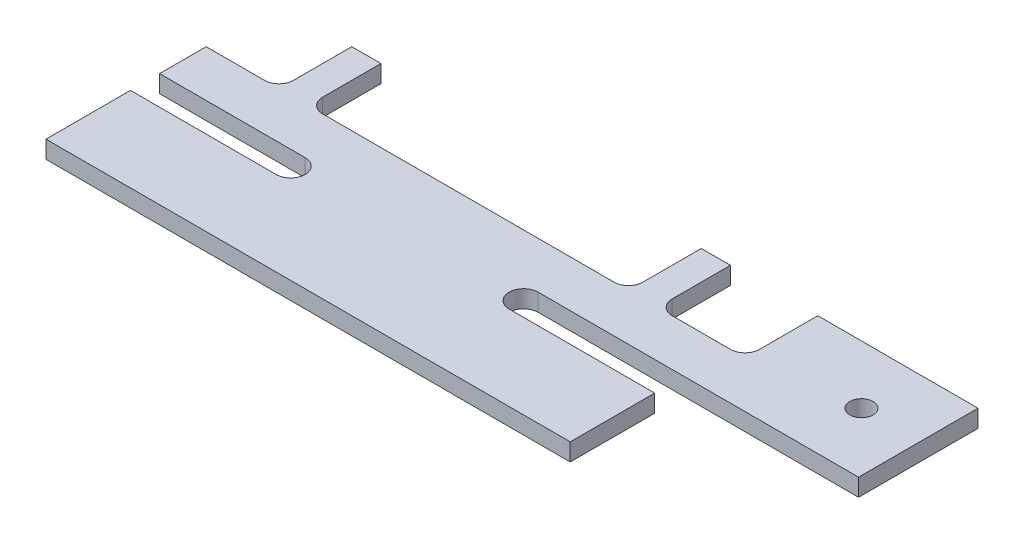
ISO-10303-21;
HEADER;
FILE_DESCRIPTION(('STEP AP214'),'2;1');
FILE_NAME('part.step','',(''),(''),'','','');
FILE_SCHEMA(('AUTOMOTIVE_DESIGN { 1 0 10303 214 1 1 1 1 }'));
ENDSEC;
DATA;
#1=APPLICATION_CONTEXT('core data for automotive mechanical design processes');
#2=APPLICATION_PROTOCOL_DEFINITION('international standard','automotive_design',2000,#1);
#3=PRODUCT_CONTEXT('',#1,'mechanical');
#4=PRODUCT('Part','Part','',(#3));
#5=PRODUCT_RELATED_PRODUCT_CATEGORY('part','',(#4));
#6=PRODUCT_DEFINITION_FORMATION('','',#4);
#7=PRODUCT_DEFINITION_CONTEXT('part definition',#1,'design');
#8=PRODUCT_DEFINITION('design','',#6,#7);
#9=PRODUCT_DEFINITION_SHAPE('','',#8);
#10=(LENGTH_UNIT() NAMED_UNIT(*) SI_UNIT(.MILLI.,.METRE.));
#11=(NAMED_UNIT(*) PLANE_ANGLE_UNIT() SI_UNIT($,.RADIAN.));
#12=(NAMED_UNIT(*) SI_UNIT($,.STERADIAN.) SOLID_ANGLE_UNIT());
#13=UNCERTAINTY_MEASURE_WITH_UNIT(LENGTH_MEASURE(1.E-05),#10,'distance_accuracy_value','');
#14=(GEOMETRIC_REPRESENTATION_CONTEXT(3) GLOBAL_UNCERTAINTY_ASSIGNED_CONTEXT((#13)) GLOBAL_UNIT_ASSIGNED_CONTEXT((#10,
#11,#12)) REPRESENTATION_CONTEXT('',''));
#15=CARTESIAN_POINT('',(0.,0.,0.));
#16=DIRECTION('',(0.,0.,1.));
#17=DIRECTION('',(1.,0.,0.));
#18=AXIS2_PLACEMENT_3D('',#15,#16,#17);
#19=CARTESIAN_POINT('',(25.,3.,-17.));
#20=DIRECTION('',(0.,1.,0.));
#21=DIRECTION('',(0.,0.,1.));
#22=AXIS2_PLACEMENT_3D('',#19,#20,#21);
#23=PLANE('',#22);
#24=DIRECTION('',(0.,0.,1.));
#25=VECTOR('',#24,1.);
#26=CARTESIAN_POINT('',(0.,3.,0.));
#27=LINE('',#26,#25);
#28=CARTESIAN_POINT('',(0.,3.,-14.5));
#29=VERTEX_POINT('',#28);
#30=CARTESIAN_POINT('',(0.,3.,0.));
#31=VERTEX_POINT('',#30);
#32=EDGE_CURVE('E286',#29,#31,#27,.T.);
#33=ORIENTED_EDGE('',*,*,#32,.T.);
#34=DIRECTION('',(1.,0.,0.));
#35=VECTOR('',#34,1.);
#36=CARTESIAN_POINT('',(0.,3.,0.));
#37=LINE('',#36,#35);
#38=CARTESIAN_POINT('',(90.,3.,0.));
#39=VERTEX_POINT('',#38);
#40=EDGE_CURVE('E225',#31,#39,#37,.T.);
#41=ORIENTED_EDGE('',*,*,#40,.T.);
#42=DIRECTION('',(0.,0.,-1.));
#43=VECTOR('',#42,1.);
#44=CARTESIAN_POINT('',(90.,3.,0.));
#45=LINE('',#44,#43);
#46=CARTESIAN_POINT('',(90.,3.,-14.5));
#47=VERTEX_POINT('',#46);
#48=EDGE_CURVE('E289',#39,#47,#45,.T.);
#49=ORIENTED_EDGE('',*,*,#48,.T.);
#50=DIRECTION('',(-1.,0.,0.));
#51=VECTOR('',#50,1.);
#52=CARTESIAN_POINT('',(65.,3.,-14.5));
#53=LINE('',#52,#51);
#54=CARTESIAN_POINT('',(65.,3.,-14.5));
#55=VERTEX_POINT('',#54);
#56=EDGE_CURVE('E291',#47,#55,#53,.T.);
#57=ORIENTED_EDGE('',*,*,#56,.T.);
#58=CARTESIAN_POINT('',(65.,3.,-17.));
#59=DIRECTION('',(0.,-1.,0.));
#60=DIRECTION('',(0.,0.,1.));
#61=AXIS2_PLACEMENT_3D('',#58,#59,#60);
#62=CIRCLE('',#61,2.5);
#63=CARTESIAN_POINT('',(65.,3.,-19.5));
#64=VERTEX_POINT('',#63);
#65=EDGE_CURVE('E293',#55,#64,#62,.T.);
#66=ORIENTED_EDGE('',*,*,#65,.T.);
#67=DIRECTION('',(1.,0.,0.));
#68=VECTOR('',#67,1.);
#69=CARTESIAN_POINT('',(65.,3.,-19.5));
#70=LINE('',#69,#68);
#71=CARTESIAN_POINT('',(120.,3.,-19.5));
#72=VERTEX_POINT('',#71);
#73=EDGE_CURVE('E295',#64,#72,#70,.T.);
#74=ORIENTED_EDGE('',*,*,#73,.T.);
#75=DIRECTION('',(0.,0.,-1.));
#76=VECTOR('',#75,1.);
#77=CARTESIAN_POINT('',(120.,3.,-19.5));
#78=LINE('',#77,#76);
#79=CARTESIAN_POINT('',(120.,3.,-40.));
#80=VERTEX_POINT('',#79);
#81=EDGE_CURVE('E297',#72,#80,#78,.T.);
#82=ORIENTED_EDGE('',*,*,#81,.T.);
#83=DIRECTION('',(-1.,0.,0.));
#84=VECTOR('',#83,1.);
#85=CARTESIAN_POINT('',(92.5,3.,-40.));
#86=LINE('',#85,#84);
#87=CARTESIAN_POINT('',(92.5,3.,-40.));
#88=VERTEX_POINT('',#87);
#89=EDGE_CURVE('E299',#80,#88,#86,.T.);
#90=ORIENTED_EDGE('',*,*,#89,.T.);
#91=DIRECTION('',(0.,0.,1.));
#92=VECTOR('',#91,1.);
#93=CARTESIAN_POINT('',(92.5,3.,-30.));
#94=LINE('',#93,#92);
#95=CARTESIAN_POINT('',(92.5,3.,-30.));
#96=VERTEX_POINT('',#95);
#97=EDGE_CURVE('E301',#88,#96,#94,.T.);
#98=ORIENTED_EDGE('',*,*,#97,.T.);
#99=CARTESIAN_POINT('',(90.,3.,-30.));
#100=DIRECTION('',(0.,-1.,0.));
#101=DIRECTION('',(0.,0.,-1.));
#102=AXIS2_PLACEMENT_3D('',#99,#100,#101);
#103=CIRCLE('',#102,2.5);
#104=CARTESIAN_POINT('',(90.,3.,-27.5));
#105=VERTEX_POINT('',#104);
#106=EDGE_CURVE('E303',#96,#105,#103,.T.);
#107=ORIENTED_EDGE('',*,*,#106,.T.);
#108=DIRECTION('',(-1.,0.,0.));
#109=VECTOR('',#108,1.);
#110=CARTESIAN_POINT('',(80.,3.,-27.5));
#111=LINE('',#110,#109);
#112=CARTESIAN_POINT('',(80.,3.,-27.5));
#113=VERTEX_POINT('',#112);
#114=EDGE_CURVE('E305',#105,#113,#111,.T.);
#115=ORIENTED_EDGE('',*,*,#114,.T.);
#116=CARTESIAN_POINT('',(80.,3.,-30.));
#117=DIRECTION('',(0.,-1.,0.));
#118=DIRECTION('',(0.,0.,-1.));
#119=AXIS2_PLACEMENT_3D('',#116,#117,#118);
#120=CIRCLE('',#119,2.5);
#121=CARTESIAN_POINT('',(77.5,3.,-30.));
#122=VERTEX_POINT('',#121);
#123=EDGE_CURVE('E307',#113,#122,#120,.T.);
#124=ORIENTED_EDGE('',*,*,#123,.T.);
#125=DIRECTION('',(0.,0.,-1.));
#126=VECTOR('',#125,1.);
#127=CARTESIAN_POINT('',(77.5,3.,-30.));
#128=LINE('',#127,#126);
#129=CARTESIAN_POINT('',(77.5,3.,-40.));
#130=VERTEX_POINT('',#129);
#131=EDGE_CURVE('E309',#122,#130,#128,.T.);
#132=ORIENTED_EDGE('',*,*,#131,.T.);
#133=DIRECTION('',(-1.,0.,0.));
#134=VECTOR('',#133,1.);
#135=CARTESIAN_POINT('',(72.5,3.,-40.));
#136=LINE('',#135,#134);
#137=CARTESIAN_POINT('',(72.5,3.,-40.));
#138=VERTEX_POINT('',#137);
#139=EDGE_CURVE('E311',#130,#138,#136,.T.);
#140=ORIENTED_EDGE('',*,*,#139,.T.);
#141=DIRECTION('',(0.,0.,1.));
#142=VECTOR('',#141,1.);
#143=CARTESIAN_POINT('',(72.5,3.,-30.));
#144=LINE('',#143,#142);
#145=CARTESIAN_POINT('',(72.5,3.,-30.));
#146=VERTEX_POINT('',#145);
#147=EDGE_CURVE('E313',#138,#146,#144,.T.);
#148=ORIENTED_EDGE('',*,*,#147,.T.);
#149=CARTESIAN_POINT('',(70.,3.,-30.));
#150=DIRECTION('',(0.,-1.,0.));
#151=DIRECTION('',(0.,0.,1.));
#152=AXIS2_PLACEMENT_3D('',#149,#150,#151);
#153=CIRCLE('',#152,2.5);
#154=CARTESIAN_POINT('',(70.,3.,-27.5));
#155=VERTEX_POINT('',#154);
#156=EDGE_CURVE('E315',#146,#155,#153,.T.);
#157=ORIENTED_EDGE('',*,*,#156,.T.);
#158=DIRECTION('',(-1.,0.,0.));
#159=VECTOR('',#158,1.);
#160=CARTESIAN_POINT('',(20.,3.,-27.5));
#161=LINE('',#160,#159);
#162=CARTESIAN_POINT('',(20.,3.,-27.5));
#163=VERTEX_POINT('',#162);
#164=EDGE_CURVE('E317',#155,#163,#161,.T.);
#165=ORIENTED_EDGE('',*,*,#164,.T.);
#166=CARTESIAN_POINT('',(20.,3.,-30.));
#167=DIRECTION('',(0.,-1.,0.));
#168=DIRECTION('',(0.,0.,-1.));
#169=AXIS2_PLACEMENT_3D('',#166,#167,#168);
#170=CIRCLE('',#169,2.5);
#171=CARTESIAN_POINT('',(17.5,3.,-30.));
#172=VERTEX_POINT('',#171);
#173=EDGE_CURVE('E319',#163,#172,#170,.T.);
#174=ORIENTED_EDGE('',*,*,#173,.T.);
#175=DIRECTION('',(0.,0.,-1.));
#176=VECTOR('',#175,1.);
#177=CARTESIAN_POINT('',(17.5,3.,-30.));
#178=LINE('',#177,#176);
#179=CARTESIAN_POINT('',(17.5,3.,-40.));
#180=VERTEX_POINT('',#179);
#181=EDGE_CURVE('E321',#172,#180,#178,.T.);
#182=ORIENTED_EDGE('',*,*,#181,.T.);
#183=DIRECTION('',(-1.,0.,0.));
#184=VECTOR('',#183,1.);
#185=CARTESIAN_POINT('',(12.5,3.,-40.));
#186=LINE('',#185,#184);
#187=CARTESIAN_POINT('',(12.5,3.,-40.));
#188=VERTEX_POINT('',#187);
#189=EDGE_CURVE('E323',#180,#188,#186,.T.);
#190=ORIENTED_EDGE('',*,*,#189,.T.);
#191=DIRECTION('',(0.,0.,1.));
#192=VECTOR('',#191,1.);
#193=CARTESIAN_POINT('',(12.5,3.,-30.));
#194=LINE('',#193,#192);
#195=CARTESIAN_POINT('',(12.5,3.,-30.));
#196=VERTEX_POINT('',#195);
#197=EDGE_CURVE('E325',#188,#196,#194,.T.);
#198=ORIENTED_EDGE('',*,*,#197,.T.);
#199=CARTESIAN_POINT('',(10.,3.,-30.));
#200=DIRECTION('',(0.,-1.,0.));
#201=DIRECTION('',(0.,0.,1.));
#202=AXIS2_PLACEMENT_3D('',#199,#200,#201);
#203=CIRCLE('',#202,2.5);
#204=CARTESIAN_POINT('',(9.99999999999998,3.,-27.5));
#205=VERTEX_POINT('',#204);
#206=EDGE_CURVE('E327',#196,#205,#203,.T.);
#207=ORIENTED_EDGE('',*,*,#206,.T.);
#208=DIRECTION('',(-1.,0.,0.));
#209=VECTOR('',#208,1.);
#210=CARTESIAN_POINT('',(0.,3.,-27.5));
#211=LINE('',#210,#209);
#212=CARTESIAN_POINT('',(0.,3.,-27.5));
#213=VERTEX_POINT('',#212);
#214=EDGE_CURVE('E329',#205,#213,#211,.T.);
#215=ORIENTED_EDGE('',*,*,#214,.T.);
#216=DIRECTION('',(0.,0.,1.));
#217=VECTOR('',#216,1.);
#218=CARTESIAN_POINT('',(0.,3.,-19.5));
#219=LINE('',#218,#217);
#220=CARTESIAN_POINT('',(0.,3.,-19.5));
#221=VERTEX_POINT('',#220);
#222=EDGE_CURVE('E331',#213,#221,#219,.T.);
#223=ORIENTED_EDGE('',*,*,#222,.T.);
#224=DIRECTION('',(1.,0.,0.));
#225=VECTOR('',#224,1.);
#226=CARTESIAN_POINT('',(0.,3.,-19.5));
#227=LINE('',#226,#225);
#228=CARTESIAN_POINT('',(25.,3.,-19.5));
#229=VERTEX_POINT('',#228);
#230=EDGE_CURVE('E333',#221,#229,#227,.T.);
#231=ORIENTED_EDGE('',*,*,#230,.T.);
#232=CARTESIAN_POINT('',(25.,3.,-17.));
#233=DIRECTION('',(0.,-1.,0.));
#234=DIRECTION('',(0.,0.,1.));
#235=AXIS2_PLACEMENT_3D('',#232,#233,#234);
#236=CIRCLE('',#235,2.5);
#237=CARTESIAN_POINT('',(25.,3.,-14.5));
#238=VERTEX_POINT('',#237);
#239=EDGE_CURVE('E52',#229,#238,#236,.T.);
#240=ORIENTED_EDGE('',*,*,#239,.T.);
#241=DIRECTION('',(-1.,0.,0.));
#242=VECTOR('',#241,1.);
#243=CARTESIAN_POINT('',(0.,3.,-14.5));
#244=LINE('',#243,#242);
#245=EDGE_CURVE('E47',#238,#29,#244,.T.);
#246=ORIENTED_EDGE('',*,*,#245,.T.);
#247=EDGE_LOOP('',(#33,#41,#49,#57,#66,#74,#82,#90,#98,#107,#115,#124,#132,#140,#148,#157,#165,
#174,#182,#190,#198,#207,#215,#223,#231,#240,#246));
#248=FACE_BOUND('',#247,.T.);
#249=CARTESIAN_POINT('',(110.,3.,-30.));
#250=DIRECTION('',(0.,1.,0.));
#251=DIRECTION('',(0.,0.,1.));
#252=AXIS2_PLACEMENT_3D('',#249,#250,#251);
#253=CIRCLE('',#252,2.);
#254=CARTESIAN_POINT('',(110.,3.,-28.));
#255=VERTEX_POINT('',#254);
#256=EDGE_CURVE('E230',#255,#255,#253,.T.);
#257=ORIENTED_EDGE('',*,*,#256,.F.);
#258=EDGE_LOOP('',(#257));
#259=FACE_BOUND('',#258,.T.);
#260=ADVANCED_FACE('F32',(#248,#259),#23,.T.);
#261=CARTESIAN_POINT('',(25.,0.,-17.));
#262=DIRECTION('',(0.,1.,0.));
#263=DIRECTION('',(0.,0.,1.));
#264=AXIS2_PLACEMENT_3D('',#261,#262,#263);
#265=PLANE('',#264);
#266=DIRECTION('',(0.,0.,1.));
#267=VECTOR('',#266,1.);
#268=CARTESIAN_POINT('',(0.,0.,0.));
#269=LINE('',#268,#267);
#270=CARTESIAN_POINT('',(0.,0.,-14.5));
#271=VERTEX_POINT('',#270);
#272=CARTESIAN_POINT('',(0.,0.,0.));
#273=VERTEX_POINT('',#272);
#274=EDGE_CURVE('E216',#271,#273,#269,.T.);
#275=ORIENTED_EDGE('',*,*,#274,.F.);
#276=DIRECTION('',(-1.,0.,0.));
#277=VECTOR('',#276,1.);
#278=CARTESIAN_POINT('',(0.,0.,-14.5));
#279=LINE('',#278,#277);
#280=CARTESIAN_POINT('',(25.,0.,-14.5));
#281=VERTEX_POINT('',#280);
#282=EDGE_CURVE('E284',#281,#271,#279,.T.);
#283=ORIENTED_EDGE('',*,*,#282,.F.);
#284=CARTESIAN_POINT('',(25.,0.,-17.));
#285=DIRECTION('',(0.,-1.,0.));
#286=DIRECTION('',(0.,0.,1.));
#287=AXIS2_PLACEMENT_3D('',#284,#285,#286);
#288=CIRCLE('',#287,2.5);
#289=CARTESIAN_POINT('',(25.,0.,-19.5));
#290=VERTEX_POINT('',#289);
#291=EDGE_CURVE('E282',#290,#281,#288,.T.);
#292=ORIENTED_EDGE('',*,*,#291,.F.);
#293=DIRECTION('',(1.,0.,0.));
#294=VECTOR('',#293,1.);
#295=CARTESIAN_POINT('',(0.,0.,-19.5));
#296=LINE('',#295,#294);
#297=CARTESIAN_POINT('',(0.,0.,-19.5));
#298=VERTEX_POINT('',#297);
#299=EDGE_CURVE('E280',#298,#290,#296,.T.);
#300=ORIENTED_EDGE('',*,*,#299,.F.);
#301=DIRECTION('',(0.,0.,1.));
#302=VECTOR('',#301,1.);
#303=CARTESIAN_POINT('',(0.,0.,-19.5));
#304=LINE('',#303,#302);
#305=CARTESIAN_POINT('',(0.,0.,-27.5));
#306=VERTEX_POINT('',#305);
#307=EDGE_CURVE('E278',#306,#298,#304,.T.);
#308=ORIENTED_EDGE('',*,*,#307,.F.);
#309=DIRECTION('',(-1.,0.,0.));
#310=VECTOR('',#309,1.);
#311=CARTESIAN_POINT('',(0.,0.,-27.5));
#312=LINE('',#311,#310);
#313=CARTESIAN_POINT('',(9.99999999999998,0.,-27.5));
#314=VERTEX_POINT('',#313);
#315=EDGE_CURVE('E276',#314,#306,#312,.T.);
#316=ORIENTED_EDGE('',*,*,#315,.F.);
#317=CARTESIAN_POINT('',(10.,0.,-30.));
#318=DIRECTION('',(0.,-1.,0.));
#319=DIRECTION('',(0.,0.,1.));
#320=AXIS2_PLACEMENT_3D('',#317,#318,#319);
#321=CIRCLE('',#320,2.5);
#322=CARTESIAN_POINT('',(12.5,0.,-30.));
#323=VERTEX_POINT('',#322);
#324=EDGE_CURVE('E274',#323,#314,#321,.T.);
#325=ORIENTED_EDGE('',*,*,#324,.F.);
#326=DIRECTION('',(0.,0.,1.));
#327=VECTOR('',#326,1.);
#328=CARTESIAN_POINT('',(12.5,0.,-30.));
#329=LINE('',#328,#327);
#330=CARTESIAN_POINT('',(12.5,0.,-40.));
#331=VERTEX_POINT('',#330);
#332=EDGE_CURVE('E272',#331,#323,#329,.T.);
#333=ORIENTED_EDGE('',*,*,#332,.F.);
#334=DIRECTION('',(-1.,0.,0.));
#335=VECTOR('',#334,1.);
#336=CARTESIAN_POINT('',(12.5,0.,-40.));
#337=LINE('',#336,#335);
#338=CARTESIAN_POINT('',(17.5,0.,-40.));
#339=VERTEX_POINT('',#338);
#340=EDGE_CURVE('E270',#339,#331,#337,.T.);
#341=ORIENTED_EDGE('',*,*,#340,.F.);
#342=DIRECTION('',(0.,0.,-1.));
#343=VECTOR('',#342,1.);
#344=CARTESIAN_POINT('',(17.5,0.,-30.));
#345=LINE('',#344,#343);
#346=CARTESIAN_POINT('',(17.5,0.,-30.));
#347=VERTEX_POINT('',#346);
#348=EDGE_CURVE('E268',#347,#339,#345,.T.);
#349=ORIENTED_EDGE('',*,*,#348,.F.);
#350=CARTESIAN_POINT('',(20.,0.,-30.));
#351=DIRECTION('',(0.,-1.,0.));
#352=DIRECTION('',(0.,0.,-1.));
#353=AXIS2_PLACEMENT_3D('',#350,#351,#352);
#354=CIRCLE('',#353,2.5);
#355=CARTESIAN_POINT('',(20.,0.,-27.5));
#356=VERTEX_POINT('',#355);
#357=EDGE_CURVE('E266',#356,#347,#354,.T.);
#358=ORIENTED_EDGE('',*,*,#357,.F.);
#359=DIRECTION('',(-1.,0.,0.));
#360=VECTOR('',#359,1.);
#361=CARTESIAN_POINT('',(20.,0.,-27.5));
#362=LINE('',#361,#360);
#363=CARTESIAN_POINT('',(70.,0.,-27.5));
#364=VERTEX_POINT('',#363);
#365=EDGE_CURVE('E264',#364,#356,#362,.T.);
#366=ORIENTED_EDGE('',*,*,#365,.F.);
#367=CARTESIAN_POINT('',(70.,0.,-30.));
#368=DIRECTION('',(0.,-1.,0.));
#369=DIRECTION('',(0.,0.,1.));
#370=AXIS2_PLACEMENT_3D('',#367,#368,#369);
#371=CIRCLE('',#370,2.5);
#372=CARTESIAN_POINT('',(72.5,0.,-30.));
#373=VERTEX_POINT('',#372);
#374=EDGE_CURVE('E262',#373,#364,#371,.T.);
#375=ORIENTED_EDGE('',*,*,#374,.F.);
#376=DIRECTION('',(0.,0.,1.));
#377=VECTOR('',#376,1.);
#378=CARTESIAN_POINT('',(72.5,0.,-30.));
#379=LINE('',#378,#377);
#380=CARTESIAN_POINT('',(72.5,0.,-40.));
#381=VERTEX_POINT('',#380);
#382=EDGE_CURVE('E260',#381,#373,#379,.T.);
#383=ORIENTED_EDGE('',*,*,#382,.F.);
#384=DIRECTION('',(-1.,0.,0.));
#385=VECTOR('',#384,1.);
#386=CARTESIAN_POINT('',(72.5,0.,-40.));
#387=LINE('',#386,#385);
#388=CARTESIAN_POINT('',(77.5,0.,-40.));
#389=VERTEX_POINT('',#388);
#390=EDGE_CURVE('E258',#389,#381,#387,.T.);
#391=ORIENTED_EDGE('',*,*,#390,.F.);
#392=DIRECTION('',(0.,0.,-1.));
#393=VECTOR('',#392,1.);
#394=CARTESIAN_POINT('',(77.5,0.,-30.));
#395=LINE('',#394,#393);
#396=CARTESIAN_POINT('',(77.5,0.,-30.));
#397=VERTEX_POINT('',#396);
#398=EDGE_CURVE('E256',#397,#389,#395,.T.);
#399=ORIENTED_EDGE('',*,*,#398,.F.);
#400=CARTESIAN_POINT('',(80.,0.,-30.));
#401=DIRECTION('',(0.,-1.,0.));
#402=DIRECTION('',(0.,0.,-1.));
#403=AXIS2_PLACEMENT_3D('',#400,#401,#402);
#404=CIRCLE('',#403,2.5);
#405=CARTESIAN_POINT('',(80.,0.,-27.5));
#406=VERTEX_POINT('',#405);
#407=EDGE_CURVE('E254',#406,#397,#404,.T.);
#408=ORIENTED_EDGE('',*,*,#407,.F.);
#409=DIRECTION('',(-1.,0.,0.));
#410=VECTOR('',#409,1.);
#411=CARTESIAN_POINT('',(80.,0.,-27.5));
#412=LINE('',#411,#410);
#413=CARTESIAN_POINT('',(90.,0.,-27.5));
#414=VERTEX_POINT('',#413);
#415=EDGE_CURVE('E252',#414,#406,#412,.T.);
#416=ORIENTED_EDGE('',*,*,#415,.F.);
#417=CARTESIAN_POINT('',(90.,0.,-30.));
#418=DIRECTION('',(0.,-1.,0.));
#419=DIRECTION('',(0.,0.,-1.));
#420=AXIS2_PLACEMENT_3D('',#417,#418,#419);
#421=CIRCLE('',#420,2.5);
#422=CARTESIAN_POINT('',(92.5,0.,-30.));
#423=VERTEX_POINT('',#422);
#424=EDGE_CURVE('E250',#423,#414,#421,.T.);
#425=ORIENTED_EDGE('',*,*,#424,.F.);
#426=DIRECTION('',(0.,0.,1.));
#427=VECTOR('',#426,1.);
#428=CARTESIAN_POINT('',(92.5,0.,-30.));
#429=LINE('',#428,#427);
#430=CARTESIAN_POINT('',(92.5,0.,-40.));
#431=VERTEX_POINT('',#430);
#432=EDGE_CURVE('E248',#431,#423,#429,.T.);
#433=ORIENTED_EDGE('',*,*,#432,.F.);
#434=DIRECTION('',(-1.,0.,0.));
#435=VECTOR('',#434,1.);
#436=CARTESIAN_POINT('',(92.5,0.,-40.));
#437=LINE('',#436,#435);
#438=CARTESIAN_POINT('',(120.,0.,-40.));
#439=VERTEX_POINT('',#438);
#440=EDGE_CURVE('E246',#439,#431,#437,.T.);
#441=ORIENTED_EDGE('',*,*,#440,.F.);
#442=DIRECTION('',(0.,0.,-1.));
#443=VECTOR('',#442,1.);
#444=CARTESIAN_POINT('',(120.,0.,-19.5));
#445=LINE('',#444,#443);
#446=CARTESIAN_POINT('',(120.,0.,-19.5));
#447=VERTEX_POINT('',#446);
#448=EDGE_CURVE('E244',#447,#439,#445,.T.);
#449=ORIENTED_EDGE('',*,*,#448,.F.);
#450=DIRECTION('',(1.,0.,0.));
#451=VECTOR('',#450,1.);
#452=CARTESIAN_POINT('',(65.,0.,-19.5));
#453=LINE('',#452,#451);
#454=CARTESIAN_POINT('',(65.,0.,-19.5));
#455=VERTEX_POINT('',#454);
#456=EDGE_CURVE('E242',#455,#447,#453,.T.);
#457=ORIENTED_EDGE('',*,*,#456,.F.);
#458=CARTESIAN_POINT('',(65.,0.,-17.));
#459=DIRECTION('',(0.,-1.,0.));
#460=DIRECTION('',(0.,0.,1.));
#461=AXIS2_PLACEMENT_3D('',#458,#459,#460);
#462=CIRCLE('',#461,2.5);
#463=CARTESIAN_POINT('',(65.,0.,-14.5));
#464=VERTEX_POINT('',#463);
#465=EDGE_CURVE('E240',#464,#455,#462,.T.);
#466=ORIENTED_EDGE('',*,*,#465,.F.);
#467=DIRECTION('',(-1.,0.,0.));
#468=VECTOR('',#467,1.);
#469=CARTESIAN_POINT('',(65.,0.,-14.5));
#470=LINE('',#469,#468);
#471=CARTESIAN_POINT('',(90.,0.,-14.5));
#472=VERTEX_POINT('',#471);
#473=EDGE_CURVE('E238',#472,#464,#470,.T.);
#474=ORIENTED_EDGE('',*,*,#473,.F.);
#475=DIRECTION('',(0.,0.,-1.));
#476=VECTOR('',#475,1.);
#477=CARTESIAN_POINT('',(90.,0.,0.));
#478=LINE('',#477,#476);
#479=CARTESIAN_POINT('',(90.,0.,0.));
#480=VERTEX_POINT('',#479);
#481=EDGE_CURVE('E218',#480,#472,#478,.T.);
#482=ORIENTED_EDGE('',*,*,#481,.F.);
#483=DIRECTION('',(1.,0.,0.));
#484=VECTOR('',#483,1.);
#485=CARTESIAN_POINT('',(0.,0.,0.));
#486=LINE('',#485,#484);
#487=EDGE_CURVE('E211',#273,#480,#486,.T.);
#488=ORIENTED_EDGE('',*,*,#487,.F.);
#489=EDGE_LOOP('',(#275,#283,#292,#300,#308,#316,#325,#333,#341,#349,#358,#366,#375,#383,#391,
#399,#408,#416,#425,#433,#441,#449,#457,#466,#474,#482,#488));
#490=FACE_BOUND('',#489,.T.);
#491=CARTESIAN_POINT('',(110.,0.,-30.));
#492=DIRECTION('',(0.,1.,0.));
#493=DIRECTION('',(0.,0.,1.));
#494=AXIS2_PLACEMENT_3D('',#491,#492,#493);
#495=CIRCLE('',#494,2.);
#496=CARTESIAN_POINT('',(110.,0.,-28.));
#497=VERTEX_POINT('',#496);
#498=EDGE_CURVE('E233',#497,#497,#495,.T.);
#499=ORIENTED_EDGE('',*,*,#498,.T.);
#500=EDGE_LOOP('',(#499));
#501=FACE_BOUND('',#500,.T.);
#502=ADVANCED_FACE('F212',(#490,#501),#265,.F.);
#503=CARTESIAN_POINT('',(0.,3.,0.));
#504=DIRECTION('',(1.,0.,0.));
#505=DIRECTION('',(0.,0.,-1.));
#506=AXIS2_PLACEMENT_3D('',#503,#504,#505);
#507=PLANE('',#506);
#508=ORIENTED_EDGE('',*,*,#274,.T.);
#509=DIRECTION('',(0.,-1.,0.));
#510=VECTOR('',#509,1.);
#511=CARTESIAN_POINT('',(0.,3.,0.));
#512=LINE('',#511,#510);
#513=EDGE_CURVE('E11',#31,#273,#512,.T.);
#514=ORIENTED_EDGE('',*,*,#513,.F.);
#515=ORIENTED_EDGE('',*,*,#32,.F.);
#516=DIRECTION('',(0.,-1.,0.));
#517=VECTOR('',#516,1.);
#518=CARTESIAN_POINT('',(0.,3.,-14.5));
#519=LINE('',#518,#517);
#520=EDGE_CURVE('E229',#29,#271,#519,.T.);
#521=ORIENTED_EDGE('',*,*,#520,.T.);
#522=EDGE_LOOP('',(#508,#514,#515,#521));
#523=FACE_BOUND('',#522,.T.);
#524=ADVANCED_FACE('F34',(#523),#507,.F.);
#525=CARTESIAN_POINT('',(0.,3.,0.));
#526=DIRECTION('',(0.,0.,-1.));
#527=DIRECTION('',(-1.,0.,0.));
#528=AXIS2_PLACEMENT_3D('',#525,#526,#527);
#529=PLANE('',#528);
#530=ORIENTED_EDGE('',*,*,#487,.T.);
#531=DIRECTION('',(0.,-1.,0.));
#532=VECTOR('',#531,1.);
#533=CARTESIAN_POINT('',(90.,3.,0.));
#534=LINE('',#533,#532);
#535=EDGE_CURVE('E40',#39,#480,#534,.T.);
#536=ORIENTED_EDGE('',*,*,#535,.F.);
#537=ORIENTED_EDGE('',*,*,#40,.F.);
#538=ORIENTED_EDGE('',*,*,#513,.T.);
#539=EDGE_LOOP('',(#530,#536,#537,#538));
#540=FACE_BOUND('',#539,.T.);
#541=ADVANCED_FACE('F224',(#540),#529,.F.);
#542=CARTESIAN_POINT('',(90.,3.,0.));
#543=DIRECTION('',(-1.,0.,0.));
#544=DIRECTION('',(0.,0.,1.));
#545=AXIS2_PLACEMENT_3D('',#542,#543,#544);
#546=PLANE('',#545);
#547=ORIENTED_EDGE('',*,*,#481,.T.);
#548=DIRECTION('',(0.,-1.,0.));
#549=VECTOR('',#548,1.);
#550=CARTESIAN_POINT('',(90.,3.,-14.5));
#551=LINE('',#550,#549);
#552=EDGE_CURVE('E407',#47,#472,#551,.T.);
#553=ORIENTED_EDGE('',*,*,#552,.F.);
#554=ORIENTED_EDGE('',*,*,#48,.F.);
#555=ORIENTED_EDGE('',*,*,#535,.T.);
#556=EDGE_LOOP('',(#547,#553,#554,#555));
#557=FACE_BOUND('',#556,.T.);
#558=ADVANCED_FACE('F411',(#557),#546,.F.);
#559=CARTESIAN_POINT('',(65.,3.,-14.5));
#560=DIRECTION('',(0.,0.,1.));
#561=DIRECTION('',(1.,0.,0.));
#562=AXIS2_PLACEMENT_3D('',#559,#560,#561);
#563=PLANE('',#562);
#564=ORIENTED_EDGE('',*,*,#473,.T.);
#565=DIRECTION('',(0.,-1.,0.));
#566=VECTOR('',#565,1.);
#567=CARTESIAN_POINT('',(65.,3.,-14.5));
#568=LINE('',#567,#566);
#569=EDGE_CURVE('E404',#55,#464,#568,.T.);
#570=ORIENTED_EDGE('',*,*,#569,.F.);
#571=ORIENTED_EDGE('',*,*,#56,.F.);
#572=ORIENTED_EDGE('',*,*,#552,.T.);
#573=EDGE_LOOP('',(#564,#570,#571,#572));
#574=FACE_BOUND('',#573,.T.);
#575=ADVANCED_FACE('F419',(#574),#563,.F.);
#576=CARTESIAN_POINT('',(65.,3.,-17.));
#577=DIRECTION('',(0.,-1.,0.));
#578=DIRECTION('',(0.,0.,-1.));
#579=AXIS2_PLACEMENT_3D('',#576,#577,#578);
#580=CYLINDRICAL_SURFACE('',#579,2.5);
#581=ORIENTED_EDGE('',*,*,#465,.T.);
#582=DIRECTION('',(0.,-1.,0.));
#583=VECTOR('',#582,1.);
#584=CARTESIAN_POINT('',(65.,3.,-19.5));
#585=LINE('',#584,#583);
#586=EDGE_CURVE('E401',#64,#455,#585,.T.);
#587=ORIENTED_EDGE('',*,*,#586,.F.);
#588=ORIENTED_EDGE('',*,*,#65,.F.);
#589=ORIENTED_EDGE('',*,*,#569,.T.);
#590=EDGE_LOOP('',(#581,#587,#588,#589));
#591=FACE_BOUND('',#590,.T.);
#592=ADVANCED_FACE('F422',(#591),#580,.F.);
#593=CARTESIAN_POINT('',(65.,3.,-19.5));
#594=DIRECTION('',(0.,0.,-1.));
#595=DIRECTION('',(-1.,0.,0.));
#596=AXIS2_PLACEMENT_3D('',#593,#594,#595);
#597=PLANE('',#596);
#598=ORIENTED_EDGE('',*,*,#456,.T.);
#599=DIRECTION('',(0.,-1.,0.));
#600=VECTOR('',#599,1.);
#601=CARTESIAN_POINT('',(120.,3.,-19.5));
#602=LINE('',#601,#600);
#603=EDGE_CURVE('E398',#72,#447,#602,.T.);
#604=ORIENTED_EDGE('',*,*,#603,.F.);
#605=ORIENTED_EDGE('',*,*,#73,.F.);
#606=ORIENTED_EDGE('',*,*,#586,.T.);
#607=EDGE_LOOP('',(#598,#604,#605,#606));
#608=FACE_BOUND('',#607,.T.);
#609=ADVANCED_FACE('F427',(#608),#597,.F.);
#610=CARTESIAN_POINT('',(120.,3.,-19.5));
#611=DIRECTION('',(-1.,0.,0.));
#612=DIRECTION('',(0.,0.,1.));
#613=AXIS2_PLACEMENT_3D('',#610,#611,#612);
#614=PLANE('',#613);
#615=ORIENTED_EDGE('',*,*,#448,.T.);
#616=DIRECTION('',(0.,-1.,0.));
#617=VECTOR('',#616,1.);
#618=CARTESIAN_POINT('',(120.,3.,-40.));
#619=LINE('',#618,#617);
#620=EDGE_CURVE('E395',#80,#439,#619,.T.);
#621=ORIENTED_EDGE('',*,*,#620,.F.);
#622=ORIENTED_EDGE('',*,*,#81,.F.);
#623=ORIENTED_EDGE('',*,*,#603,.T.);
#624=EDGE_LOOP('',(#615,#621,#622,#623));
#625=FACE_BOUND('',#624,.T.);
#626=ADVANCED_FACE('F433',(#625),#614,.F.);
#627=CARTESIAN_POINT('',(92.5,3.,-40.));
#628=DIRECTION('',(0.,0.,1.));
#629=DIRECTION('',(1.,0.,0.));
#630=AXIS2_PLACEMENT_3D('',#627,#628,#629);
#631=PLANE('',#630);
#632=ORIENTED_EDGE('',*,*,#440,.T.);
#633=DIRECTION('',(0.,-1.,0.));
#634=VECTOR('',#633,1.);
#635=CARTESIAN_POINT('',(92.5,3.,-40.));
#636=LINE('',#635,#634);
#637=EDGE_CURVE('E392',#88,#431,#636,.T.);
#638=ORIENTED_EDGE('',*,*,#637,.F.);
#639=ORIENTED_EDGE('',*,*,#89,.F.);
#640=ORIENTED_EDGE('',*,*,#620,.T.);
#641=EDGE_LOOP('',(#632,#638,#639,#640));
#642=FACE_BOUND('',#641,.T.);
#643=ADVANCED_FACE('F437',(#642),#631,.F.);
#644=CARTESIAN_POINT('',(92.5,3.,-30.));
#645=DIRECTION('',(1.,0.,0.));
#646=DIRECTION('',(0.,0.,-1.));
#647=AXIS2_PLACEMENT_3D('',#644,#645,#646);
#648=PLANE('',#647);
#649=ORIENTED_EDGE('',*,*,#432,.T.);
#650=DIRECTION('',(0.,-1.,0.));
#651=VECTOR('',#650,1.);
#652=CARTESIAN_POINT('',(92.5,3.,-30.));
#653=LINE('',#652,#651);
#654=EDGE_CURVE('E389',#96,#423,#653,.T.);
#655=ORIENTED_EDGE('',*,*,#654,.F.);
#656=ORIENTED_EDGE('',*,*,#97,.F.);
#657=ORIENTED_EDGE('',*,*,#637,.T.);
#658=EDGE_LOOP('',(#649,#655,#656,#657));
#659=FACE_BOUND('',#658,.T.);
#660=ADVANCED_FACE('F442',(#659),#648,.F.);
#661=CARTESIAN_POINT('',(90.,3.,-30.));
#662=DIRECTION('',(0.,-1.,0.));
#663=DIRECTION('',(0.,0.,-1.));
#664=AXIS2_PLACEMENT_3D('',#661,#662,#663);
#665=CYLINDRICAL_SURFACE('',#664,2.5);
#666=ORIENTED_EDGE('',*,*,#424,.T.);
#667=DIRECTION('',(0.,-1.,0.));
#668=VECTOR('',#667,1.);
#669=CARTESIAN_POINT('',(90.,3.,-27.5));
#670=LINE('',#669,#668);
#671=EDGE_CURVE('E386',#105,#414,#670,.T.);
#672=ORIENTED_EDGE('',*,*,#671,.F.);
#673=ORIENTED_EDGE('',*,*,#106,.F.);
#674=ORIENTED_EDGE('',*,*,#654,.T.);
#675=EDGE_LOOP('',(#666,#672,#673,#674));
#676=FACE_BOUND('',#675,.T.);
#677=ADVANCED_FACE('F448',(#676),#665,.F.);
#678=CARTESIAN_POINT('',(80.,3.,-27.5));
#679=DIRECTION('',(0.,0.,1.));
#680=DIRECTION('',(1.,0.,0.));
#681=AXIS2_PLACEMENT_3D('',#678,#679,#680);
#682=PLANE('',#681);
#683=ORIENTED_EDGE('',*,*,#415,.T.);
#684=DIRECTION('',(0.,-1.,0.));
#685=VECTOR('',#684,1.);
#686=CARTESIAN_POINT('',(80.,3.,-27.5));
#687=LINE('',#686,#685);
#688=EDGE_CURVE('E383',#113,#406,#687,.T.);
#689=ORIENTED_EDGE('',*,*,#688,.F.);
#690=ORIENTED_EDGE('',*,*,#114,.F.);
#691=ORIENTED_EDGE('',*,*,#671,.T.);
#692=EDGE_LOOP('',(#683,#689,#690,#691));
#693=FACE_BOUND('',#692,.T.);
#694=ADVANCED_FACE('F452',(#693),#682,.F.);
#695=CARTESIAN_POINT('',(80.,3.,-30.));
#696=DIRECTION('',(0.,-1.,0.));
#697=DIRECTION('',(0.,0.,-1.));
#698=AXIS2_PLACEMENT_3D('',#695,#696,#697);
#699=CYLINDRICAL_SURFACE('',#698,2.5);
#700=ORIENTED_EDGE('',*,*,#407,.T.);
#701=DIRECTION('',(0.,-1.,0.));
#702=VECTOR('',#701,1.);
#703=CARTESIAN_POINT('',(77.5,3.,-30.));
#704=LINE('',#703,#702);
#705=EDGE_CURVE('E380',#122,#397,#704,.T.);
#706=ORIENTED_EDGE('',*,*,#705,.F.);
#707=ORIENTED_EDGE('',*,*,#123,.F.);
#708=ORIENTED_EDGE('',*,*,#688,.T.);
#709=EDGE_LOOP('',(#700,#706,#707,#708));
#710=FACE_BOUND('',#709,.T.);
#711=ADVANCED_FACE('F457',(#710),#699,.F.);
#712=CARTESIAN_POINT('',(77.5,3.,-30.));
#713=DIRECTION('',(-1.,0.,0.));
#714=DIRECTION('',(0.,0.,1.));
#715=AXIS2_PLACEMENT_3D('',#712,#713,#714);
#716=PLANE('',#715);
#717=ORIENTED_EDGE('',*,*,#398,.T.);
#718=DIRECTION('',(0.,-1.,0.));
#719=VECTOR('',#718,1.);
#720=CARTESIAN_POINT('',(77.5,3.,-40.));
#721=LINE('',#720,#719);
#722=EDGE_CURVE('E377',#130,#389,#721,.T.);
#723=ORIENTED_EDGE('',*,*,#722,.F.);
#724=ORIENTED_EDGE('',*,*,#131,.F.);
#725=ORIENTED_EDGE('',*,*,#705,.T.);
#726=EDGE_LOOP('',(#717,#723,#724,#725));
#727=FACE_BOUND('',#726,.T.);
#728=ADVANCED_FACE('F463',(#727),#716,.F.);
#729=CARTESIAN_POINT('',(72.5,3.,-40.));
#730=DIRECTION('',(0.,0.,1.));
#731=DIRECTION('',(1.,0.,0.));
#732=AXIS2_PLACEMENT_3D('',#729,#730,#731);
#733=PLANE('',#732);
#734=ORIENTED_EDGE('',*,*,#390,.T.);
#735=DIRECTION('',(0.,-1.,0.));
#736=VECTOR('',#735,1.);
#737=CARTESIAN_POINT('',(72.5,3.,-40.));
#738=LINE('',#737,#736);
#739=EDGE_CURVE('E374',#138,#381,#738,.T.);
#740=ORIENTED_EDGE('',*,*,#739,.F.);
#741=ORIENTED_EDGE('',*,*,#139,.F.);
#742=ORIENTED_EDGE('',*,*,#722,.T.);
#743=EDGE_LOOP('',(#734,#740,#741,#742));
#744=FACE_BOUND('',#743,.T.);
#745=ADVANCED_FACE('F467',(#744),#733,.F.);
#746=CARTESIAN_POINT('',(72.5,3.,-30.));
#747=DIRECTION('',(1.,0.,0.));
#748=DIRECTION('',(0.,0.,-1.));
#749=AXIS2_PLACEMENT_3D('',#746,#747,#748);
#750=PLANE('',#749);
#751=ORIENTED_EDGE('',*,*,#382,.T.);
#752=DIRECTION('',(0.,-1.,0.));
#753=VECTOR('',#752,1.);
#754=CARTESIAN_POINT('',(72.5,3.,-30.));
#755=LINE('',#754,#753);
#756=EDGE_CURVE('E371',#146,#373,#755,.T.);
#757=ORIENTED_EDGE('',*,*,#756,.F.);
#758=ORIENTED_EDGE('',*,*,#147,.F.);
#759=ORIENTED_EDGE('',*,*,#739,.T.);
#760=EDGE_LOOP('',(#751,#757,#758,#759));
#761=FACE_BOUND('',#760,.T.);
#762=ADVANCED_FACE('F472',(#761),#750,.F.);
#763=CARTESIAN_POINT('',(70.,3.,-30.));
#764=DIRECTION('',(0.,-1.,0.));
#765=DIRECTION('',(0.,0.,-1.));
#766=AXIS2_PLACEMENT_3D('',#763,#764,#765);
#767=CYLINDRICAL_SURFACE('',#766,2.5);
#768=ORIENTED_EDGE('',*,*,#374,.T.);
#769=DIRECTION('',(0.,-1.,0.));
#770=VECTOR('',#769,1.);
#771=CARTESIAN_POINT('',(70.,3.,-27.5));
#772=LINE('',#771,#770);
#773=EDGE_CURVE('E368',#155,#364,#772,.T.);
#774=ORIENTED_EDGE('',*,*,#773,.F.);
#775=ORIENTED_EDGE('',*,*,#156,.F.);
#776=ORIENTED_EDGE('',*,*,#756,.T.);
#777=EDGE_LOOP('',(#768,#774,#775,#776));
#778=FACE_BOUND('',#777,.T.);
#779=ADVANCED_FACE('F478',(#778),#767,.F.);
#780=CARTESIAN_POINT('',(20.,3.,-27.5));
#781=DIRECTION('',(0.,0.,1.));
#782=DIRECTION('',(1.,0.,0.));
#783=AXIS2_PLACEMENT_3D('',#780,#781,#782);
#784=PLANE('',#783);
#785=ORIENTED_EDGE('',*,*,#365,.T.);
#786=DIRECTION('',(0.,-1.,0.));
#787=VECTOR('',#786,1.);
#788=CARTESIAN_POINT('',(20.,3.,-27.5));
#789=LINE('',#788,#787);
#790=EDGE_CURVE('E365',#163,#356,#789,.T.);
#791=ORIENTED_EDGE('',*,*,#790,.F.);
#792=ORIENTED_EDGE('',*,*,#164,.F.);
#793=ORIENTED_EDGE('',*,*,#773,.T.);
#794=EDGE_LOOP('',(#785,#791,#792,#793));
#795=FACE_BOUND('',#794,.T.);
#796=ADVANCED_FACE('F482',(#795),#784,.F.);
#797=CARTESIAN_POINT('',(20.,3.,-30.));
#798=DIRECTION('',(0.,-1.,0.));
#799=DIRECTION('',(0.,0.,-1.));
#800=AXIS2_PLACEMENT_3D('',#797,#798,#799);
#801=CYLINDRICAL_SURFACE('',#800,2.5);
#802=ORIENTED_EDGE('',*,*,#357,.T.);
#803=DIRECTION('',(0.,-1.,0.));
#804=VECTOR('',#803,1.);
#805=CARTESIAN_POINT('',(17.5,3.,-30.));
#806=LINE('',#805,#804);
#807=EDGE_CURVE('E362',#172,#347,#806,.T.);
#808=ORIENTED_EDGE('',*,*,#807,.F.);
#809=ORIENTED_EDGE('',*,*,#173,.F.);
#810=ORIENTED_EDGE('',*,*,#790,.T.);
#811=EDGE_LOOP('',(#802,#808,#809,#810));
#812=FACE_BOUND('',#811,.T.);
#813=ADVANCED_FACE('F487',(#812),#801,.F.);
#814=CARTESIAN_POINT('',(17.5,3.,-30.));
#815=DIRECTION('',(-1.,0.,0.));
#816=DIRECTION('',(0.,0.,1.));
#817=AXIS2_PLACEMENT_3D('',#814,#815,#816);
#818=PLANE('',#817);
#819=ORIENTED_EDGE('',*,*,#348,.T.);
#820=DIRECTION('',(0.,-1.,0.));
#821=VECTOR('',#820,1.);
#822=CARTESIAN_POINT('',(17.5,3.,-40.));
#823=LINE('',#822,#821);
#824=EDGE_CURVE('E359',#180,#339,#823,.T.);
#825=ORIENTED_EDGE('',*,*,#824,.F.);
#826=ORIENTED_EDGE('',*,*,#181,.F.);
#827=ORIENTED_EDGE('',*,*,#807,.T.);
#828=EDGE_LOOP('',(#819,#825,#826,#827));
#829=FACE_BOUND('',#828,.T.);
#830=ADVANCED_FACE('F493',(#829),#818,.F.);
#831=CARTESIAN_POINT('',(12.5,3.,-40.));
#832=DIRECTION('',(0.,0.,1.));
#833=DIRECTION('',(1.,0.,0.));
#834=AXIS2_PLACEMENT_3D('',#831,#832,#833);
#835=PLANE('',#834);
#836=ORIENTED_EDGE('',*,*,#340,.T.);
#837=DIRECTION('',(0.,-1.,0.));
#838=VECTOR('',#837,1.);
#839=CARTESIAN_POINT('',(12.5,3.,-40.));
#840=LINE('',#839,#838);
#841=EDGE_CURVE('E356',#188,#331,#840,.T.);
#842=ORIENTED_EDGE('',*,*,#841,.F.);
#843=ORIENTED_EDGE('',*,*,#189,.F.);
#844=ORIENTED_EDGE('',*,*,#824,.T.);
#845=EDGE_LOOP('',(#836,#842,#843,#844));
#846=FACE_BOUND('',#845,.T.);
#847=ADVANCED_FACE('F497',(#846),#835,.F.);
#848=CARTESIAN_POINT('',(12.5,3.,-30.));
#849=DIRECTION('',(1.,0.,0.));
#850=DIRECTION('',(0.,0.,-1.));
#851=AXIS2_PLACEMENT_3D('',#848,#849,#850);
#852=PLANE('',#851);
#853=ORIENTED_EDGE('',*,*,#332,.T.);
#854=DIRECTION('',(0.,-1.,0.));
#855=VECTOR('',#854,1.);
#856=CARTESIAN_POINT('',(12.5,3.,-30.));
#857=LINE('',#856,#855);
#858=EDGE_CURVE('E353',#196,#323,#857,.T.);
#859=ORIENTED_EDGE('',*,*,#858,.F.);
#860=ORIENTED_EDGE('',*,*,#197,.F.);
#861=ORIENTED_EDGE('',*,*,#841,.T.);
#862=EDGE_LOOP('',(#853,#859,#860,#861));
#863=FACE_BOUND('',#862,.T.);
#864=ADVANCED_FACE('F502',(#863),#852,.F.);
#865=CARTESIAN_POINT('',(10.,3.,-30.));
#866=DIRECTION('',(0.,-1.,0.));
#867=DIRECTION('',(0.,0.,-1.));
#868=AXIS2_PLACEMENT_3D('',#865,#866,#867);
#869=CYLINDRICAL_SURFACE('',#868,2.5);
#870=ORIENTED_EDGE('',*,*,#324,.T.);
#871=DIRECTION('',(0.,-1.,0.));
#872=VECTOR('',#871,1.);
#873=CARTESIAN_POINT('',(9.99999999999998,3.,-27.5));
#874=LINE('',#873,#872);
#875=EDGE_CURVE('E350',#205,#314,#874,.T.);
#876=ORIENTED_EDGE('',*,*,#875,.F.);
#877=ORIENTED_EDGE('',*,*,#206,.F.);
#878=ORIENTED_EDGE('',*,*,#858,.T.);
#879=EDGE_LOOP('',(#870,#876,#877,#878));
#880=FACE_BOUND('',#879,.T.);
#881=ADVANCED_FACE('F508',(#880),#869,.F.);
#882=CARTESIAN_POINT('',(0.,3.,-27.5));
#883=DIRECTION('',(0.,0.,1.));
#884=DIRECTION('',(1.,0.,0.));
#885=AXIS2_PLACEMENT_3D('',#882,#883,#884);
#886=PLANE('',#885);
#887=ORIENTED_EDGE('',*,*,#315,.T.);
#888=DIRECTION('',(0.,-1.,0.));
#889=VECTOR('',#888,1.);
#890=CARTESIAN_POINT('',(0.,3.,-27.5));
#891=LINE('',#890,#889);
#892=EDGE_CURVE('E347',#213,#306,#891,.T.);
#893=ORIENTED_EDGE('',*,*,#892,.F.);
#894=ORIENTED_EDGE('',*,*,#214,.F.);
#895=ORIENTED_EDGE('',*,*,#875,.T.);
#896=EDGE_LOOP('',(#887,#893,#894,#895));
#897=FACE_BOUND('',#896,.T.);
#898=ADVANCED_FACE('F512',(#897),#886,.F.);
#899=CARTESIAN_POINT('',(0.,3.,-19.5));
#900=DIRECTION('',(1.,0.,0.));
#901=DIRECTION('',(0.,0.,-1.));
#902=AXIS2_PLACEMENT_3D('',#899,#900,#901);
#903=PLANE('',#902);
#904=ORIENTED_EDGE('',*,*,#307,.T.);
#905=DIRECTION('',(0.,-1.,0.));
#906=VECTOR('',#905,1.);
#907=CARTESIAN_POINT('',(0.,3.,-19.5));
#908=LINE('',#907,#906);
#909=EDGE_CURVE('E344',#221,#298,#908,.T.);
#910=ORIENTED_EDGE('',*,*,#909,.F.);
#911=ORIENTED_EDGE('',*,*,#222,.F.);
#912=ORIENTED_EDGE('',*,*,#892,.T.);
#913=EDGE_LOOP('',(#904,#910,#911,#912));
#914=FACE_BOUND('',#913,.T.);
#915=ADVANCED_FACE('F517',(#914),#903,.F.);
#916=CARTESIAN_POINT('',(0.,3.,-19.5));
#917=DIRECTION('',(0.,0.,-1.));
#918=DIRECTION('',(-1.,0.,0.));
#919=AXIS2_PLACEMENT_3D('',#916,#917,#918);
#920=PLANE('',#919);
#921=ORIENTED_EDGE('',*,*,#299,.T.);
#922=DIRECTION('',(0.,-1.,0.));
#923=VECTOR('',#922,1.);
#924=CARTESIAN_POINT('',(25.,3.,-19.5));
#925=LINE('',#924,#923);
#926=EDGE_CURVE('E341',#229,#290,#925,.T.);
#927=ORIENTED_EDGE('',*,*,#926,.F.);
#928=ORIENTED_EDGE('',*,*,#230,.F.);
#929=ORIENTED_EDGE('',*,*,#909,.T.);
#930=EDGE_LOOP('',(#921,#927,#928,#929));
#931=FACE_BOUND('',#930,.T.);
#932=ADVANCED_FACE('F521',(#931),#920,.F.);
#933=CARTESIAN_POINT('',(25.,3.,-17.));
#934=DIRECTION('',(0.,-1.,0.));
#935=DIRECTION('',(0.,0.,-1.));
#936=AXIS2_PLACEMENT_3D('',#933,#934,#935);
#937=CYLINDRICAL_SURFACE('',#936,2.5);
#938=ORIENTED_EDGE('',*,*,#291,.T.);
#939=DIRECTION('',(0.,-1.,0.));
#940=VECTOR('',#939,1.);
#941=CARTESIAN_POINT('',(25.,3.,-14.5));
#942=LINE('',#941,#940);
#943=EDGE_CURVE('E338',#238,#281,#942,.T.);
#944=ORIENTED_EDGE('',*,*,#943,.F.);
#945=ORIENTED_EDGE('',*,*,#239,.F.);
#946=ORIENTED_EDGE('',*,*,#926,.T.);
#947=EDGE_LOOP('',(#938,#944,#945,#946));
#948=FACE_BOUND('',#947,.T.);
#949=ADVANCED_FACE('F525',(#948),#937,.F.);
#950=CARTESIAN_POINT('',(0.,3.,-14.5));
#951=DIRECTION('',(0.,0.,1.));
#952=DIRECTION('',(1.,0.,0.));
#953=AXIS2_PLACEMENT_3D('',#950,#951,#952);
#954=PLANE('',#953);
#955=ORIENTED_EDGE('',*,*,#282,.T.);
#956=ORIENTED_EDGE('',*,*,#520,.F.);
#957=ORIENTED_EDGE('',*,*,#245,.F.);
#958=ORIENTED_EDGE('',*,*,#943,.T.);
#959=EDGE_LOOP('',(#955,#956,#957,#958));
#960=FACE_BOUND('',#959,.T.);
#961=ADVANCED_FACE('F527',(#960),#954,.F.);
#962=CARTESIAN_POINT('',(110.,3.,-30.));
#963=DIRECTION('',(0.,-1.,0.));
#964=DIRECTION('',(0.,0.,-1.));
#965=AXIS2_PLACEMENT_3D('',#962,#963,#964);
#966=CYLINDRICAL_SURFACE('',#965,2.);
#967=ORIENTED_EDGE('',*,*,#256,.T.);
#968=EDGE_LOOP('',(#967));
#969=FACE_BOUND('',#968,.T.);
#970=ORIENTED_EDGE('',*,*,#498,.F.);
#971=EDGE_LOOP('',(#970));
#972=FACE_BOUND('',#971,.T.);
#973=ADVANCED_FACE('F529',(#969,#972),#966,.F.);
#974=CLOSED_SHELL('',(#260,#502,#524,#541,#558,#575,#592,#609,#626,#643,#660,#677,#694,#711,
#728,#745,#762,#779,#796,#813,#830,#847,#864,#881,#898,#915,#932,#949,#961,#973));
#975=MANIFOLD_SOLID_BREP('B2',#974);
#976=ADVANCED_BREP_SHAPE_REPRESENTATION('',(#18,#975),#14);
#977=SHAPE_DEFINITION_REPRESENTATION(#9,#976);
ENDSEC;
END-ISO-10303-21;
